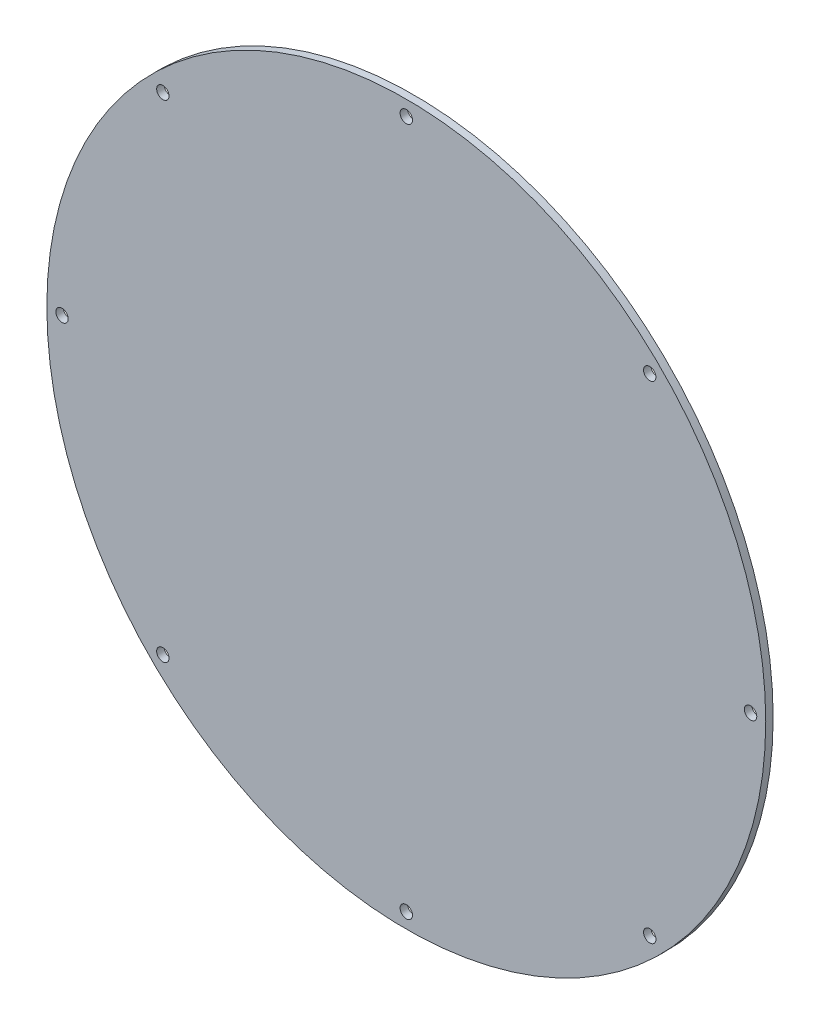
from build123d import *

# Parameters (mm, degrees)
SKETCH1_R           = 154
BOSS_EXTRUDE1_DEPTH = 3.175
CIRPATTERN2_COUNT   = 8


with BuildPart() as part:
    # Sketch1 → Boss-Extrude1 (new body)
    with BuildSketch(Plane.XY):
        Circle(SKETCH1_R)
    extrude(amount=BOSS_EXTRUDE1_DEPTH)

    # Sketch14 → M5 Clearance Hole1 (revolve, cut)
    with BuildSketch(Plane(origin=(147.5, 0, 3.175), x_dir=(0, -1, 0), z_dir=(1, 0, 0))):
        Polygon((0, 0), (0, 26.99228064), (2.65, 25.4), (2.65, 0), align=None)
    m5_clearance_hole1 = revolve(axis=Axis((147.5, 0, 9.525), (0, 0, -1)), mode=Mode.SUBTRACT)

    # CirPattern2: M5 Clearance Hole1 ×8 about axis
    cirpattern2_axis = Axis((0, 0, 0), (0, 0, 1))
    for i in range(1, CIRPATTERN2_COUNT):
        add(m5_clearance_hole1.rotate(cirpattern2_axis, i * 360 / CIRPATTERN2_COUNT), mode=Mode.SUBTRACT)


solid = part.part
